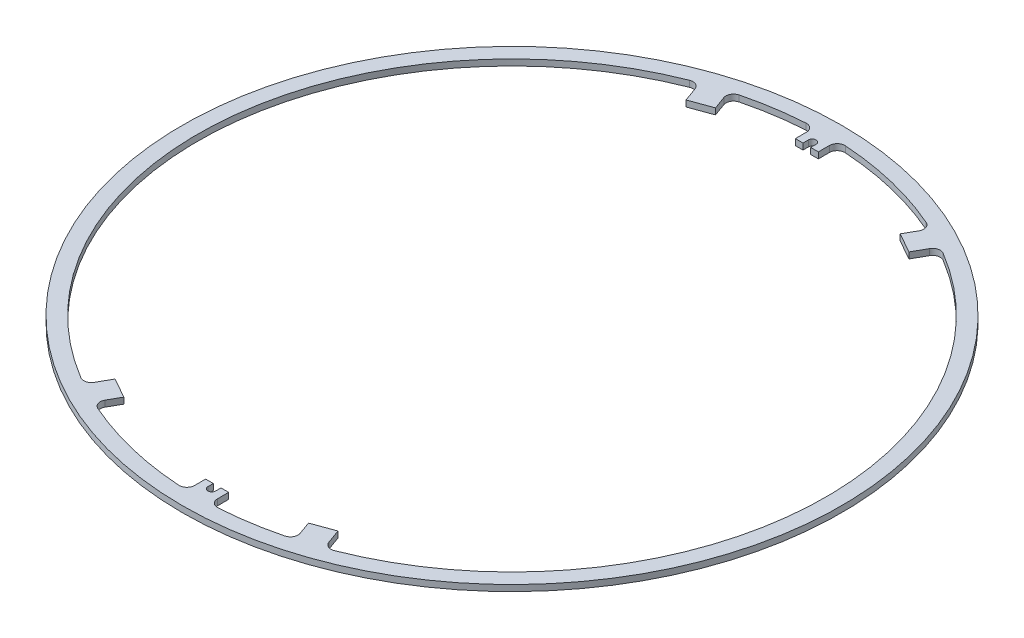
from build123d import *

# Parameters (mm, degrees)
SKETCH_1_R          = 43
SKETCH_1_R_2        = 41
EXTRUDE_1_DEPTH     = 0.8
EXTRUDE_START       = -0.8
EXTRUDE_2_DEPTH     = 0.8
FILLET_1_R          = 1
FILLET_2_R          = 1
CUT_EXTRUDE_1_DEPTH = 61.816445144
EXTRUDE_3_DEPTH     = 0.8
FILLET_3_R          = 1
EXTRUDE_4_DEPTH     = 0.8
FILLET_4_R          = 1


with BuildPart() as part:
    # Sketch 1 → Extrude 1 (new body)
    with BuildSketch(Plane(origin=(0, 0, 0), x_dir=(1, 0, 0), z_dir=(0, 1, 0))):
        with Locations(Location((0, 0, 0), (0, 0, 270))):
            Circle(SKETCH_1_R)
        with Locations(Location((0, 0, 0), (0, 0, 270))):
            Circle(SKETCH_1_R_2, mode=Mode.SUBTRACT)
    extrude(amount=EXTRUDE_1_DEPTH)

    # Sketch 2 → Extrude 2 (add)
    with BuildSketch(Plane(origin=(0, 0.8, 0), x_dir=(1, 0, 0), z_dir=(0, 1, 0)).offset(EXTRUDE_START)):
        with BuildLine():
            Line((-1.5, -38.472551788), (-1.5, -40.972551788))
            ThreePointArc((-1.5, -40.972551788), (0, -41), (1.5, -40.972551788))
            Line((1.5, -40.972551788), (1.5, -38.472551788))
            Line((1.5, -38.472551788), (-1.5, -38.472551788))
        make_face()
        with BuildLine():
            ThreePointArc((1.5, 40.972551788), (0, 41), (-1.5, 40.972551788))
            Line((-1.5, 40.972551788), (-1.5, 38.472551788))
            Line((-1.5, 38.472551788), (1.5, 38.472551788))
            Line((1.5, 38.472551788), (1.5, 40.972551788))
        make_face()
    extrude(amount=EXTRUDE_2_DEPTH)

    # Fillet 1
    fillet_1_edges = [part.edges().sort_by_distance(p)[0] for p in [
        (-1.5, 0.4, -40.972551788),
        (1.5, 0.4, -40.972551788),
    ]]
    fillet(fillet_1_edges, radius=FILLET_1_R)

    # Fillet 2
    fillet_2_edges = [part.edges().sort_by_distance(p)[0] for p in [
        (-1.5, 0.4, 40.972551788),
        (1.5, 0.4, 40.972551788),
    ]]
    fillet(fillet_2_edges, radius=FILLET_2_R)

    # Sketch 3 → Cut-Extrude 1 (cut, through all)
    with BuildSketch(Plane.XZ):
        with BuildLine():
            Line((-0.5, 39.172551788), (-0.5, 36.172551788))
            Line((-0.5, 36.172551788), (0.5, 36.172551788))
            Line((0.5, 36.172551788), (0.5, 39.172551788))
            ThreePointArc((0.5, 39.172551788), (0, 39.672551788), (-0.5, 39.172551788))
        make_face()
        with BuildLine():
            Line((0.5, -36.172551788), (0.5, -39.172551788))
            ThreePointArc((0.5, -39.172551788), (0, -39.672551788), (-0.5, -39.172551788))
            Line((-0.5, -39.172551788), (-0.5, -36.172551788))
            Line((-0.5, -36.172551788), (0.5, -36.172551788))
        make_face()
    extrude(amount=-CUT_EXTRUDE_1_DEPTH, mode=Mode.SUBTRACT)

    # Sketch 4 → Extrude 3 (add)
    with BuildSketch(Plane(origin=(0, 0.8, 0), x_dir=(1, 0, 0), z_dir=(0, 1, 0)).offset(EXTRUDE_START)):
        with BuildLine():
            Line((-20.189365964, -35.684583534), (-18.712095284, -33.073516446))
            Line((-18.712095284, -33.073516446), (-16.101028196, -34.550787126))
            Line((-16.101028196, -34.550787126), (-17.524179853, -37.066199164))
            ThreePointArc((-17.524179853, -37.066199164), (-18.869422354, -36.399792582), (-20.189365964, -35.684583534))
        make_face()
        with BuildLine():
            Line((20.189365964, 35.684583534), (18.712095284, 33.073516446))
            Line((18.712095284, 33.073516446), (16.101028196, 34.550787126))
            Line((16.101028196, 34.550787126), (17.524179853, 37.066199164))
            ThreePointArc((17.524179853, 37.066199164), (18.869422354, 36.399792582), (20.189365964, 35.684583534))
        make_face()
    extrude(amount=EXTRUDE_3_DEPTH)

    # Fillet 3
    fillet_3_edges = [part.edges().sort_by_distance(p)[0] for p in [
        (-17.524179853, 0.4, 37.066199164),
        (-20.189365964, 0.4, 35.684583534),
        (17.524179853, 0.4, -37.066199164),
        (20.189365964, 0.4, -35.684583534),
    ]]
    fillet(fillet_3_edges, radius=FILLET_3_R)

    # Sketch 5 → Extrude 4 (add)
    with BuildSketch(Plane.XZ):
        with BuildLine():
            Line((14.022825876, 38.527397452), (12.996765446, 35.70831959))
            Line((12.996765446, 35.70831959), (10.177687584, 36.73438002))
            Line((10.177687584, 36.73438002), (11.166158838, 39.450182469))
            ThreePointArc((11.166158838, 39.450182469), (12.602940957, 39.014944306), (14.022825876, 38.527397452))
        make_face()
        with BuildLine():
            Line((-10.177687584, -36.73438002), (-11.166158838, -39.450182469))
            ThreePointArc((-11.166158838, -39.450182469), (-12.602940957, -39.014944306), (-14.022825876, -38.527397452))
            Line((-14.022825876, -38.527397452), (-12.996765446, -35.70831959))
            Line((-12.996765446, -35.70831959), (-10.177687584, -36.73438002))
        make_face()
    extrude(amount=-EXTRUDE_4_DEPTH)

    # Fillet 4
    fillet_4_edges = [part.edges().sort_by_distance(p)[0] for p in [
        (14.022825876, 0.4, 38.527397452),
        (11.166158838, 0.4, 39.450182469),
        (-14.022825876, 0.4, -38.527397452),
        (-11.166158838, 0.4, -39.450182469),
    ]]
    fillet(fillet_4_edges, radius=FILLET_4_R)


solid = part.part
